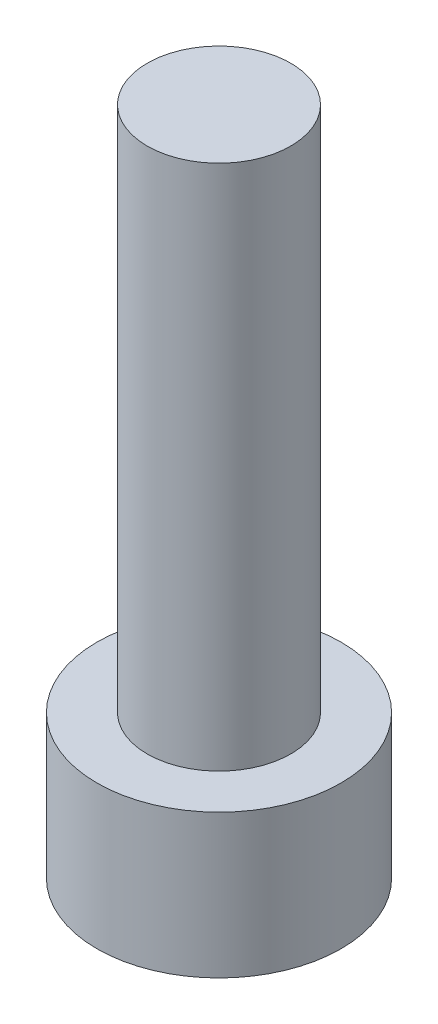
ISO-10303-21;
HEADER;
FILE_DESCRIPTION(('STEP AP214'),'2;1');
FILE_NAME('part.step','',(''),(''),'','','');
FILE_SCHEMA(('AUTOMOTIVE_DESIGN { 1 0 10303 214 1 1 1 1 }'));
ENDSEC;
DATA;
#1=APPLICATION_CONTEXT('core data for automotive mechanical design processes');
#2=APPLICATION_PROTOCOL_DEFINITION('international standard','automotive_design',2000,#1);
#3=PRODUCT_CONTEXT('',#1,'mechanical');
#4=PRODUCT('Part','Part','',(#3));
#5=PRODUCT_RELATED_PRODUCT_CATEGORY('part','',(#4));
#6=PRODUCT_DEFINITION_FORMATION('','',#4);
#7=PRODUCT_DEFINITION_CONTEXT('part definition',#1,'design');
#8=PRODUCT_DEFINITION('design','',#6,#7);
#9=PRODUCT_DEFINITION_SHAPE('','',#8);
#10=(LENGTH_UNIT() NAMED_UNIT(*) SI_UNIT(.MILLI.,.METRE.));
#11=(NAMED_UNIT(*) PLANE_ANGLE_UNIT() SI_UNIT($,.RADIAN.));
#12=(NAMED_UNIT(*) SI_UNIT($,.STERADIAN.) SOLID_ANGLE_UNIT());
#13=UNCERTAINTY_MEASURE_WITH_UNIT(LENGTH_MEASURE(1.E-05),#10,'distance_accuracy_value','');
#14=(GEOMETRIC_REPRESENTATION_CONTEXT(3) GLOBAL_UNCERTAINTY_ASSIGNED_CONTEXT((#13)) GLOBAL_UNIT_ASSIGNED_CONTEXT((#10,
#11,#12)) REPRESENTATION_CONTEXT('',''));
#15=CARTESIAN_POINT('',(0.,0.,0.));
#16=DIRECTION('',(0.,0.,1.));
#17=DIRECTION('',(1.,0.,0.));
#18=AXIS2_PLACEMENT_3D('',#15,#16,#17);
#19=CARTESIAN_POINT('',(0.,6.,0.));
#20=DIRECTION('',(0.,-1.,0.));
#21=DIRECTION('',(0.,0.,-1.));
#22=AXIS2_PLACEMENT_3D('',#19,#20,#21);
#23=CYLINDRICAL_SURFACE('',#22,5.1);
#24=CARTESIAN_POINT('',(0.,6.,0.));
#25=DIRECTION('',(0.,1.,0.));
#26=DIRECTION('',(0.,0.,1.));
#27=AXIS2_PLACEMENT_3D('',#24,#25,#26);
#28=CIRCLE('',#27,5.1);
#29=CARTESIAN_POINT('',(0.,6.,5.1));
#30=VERTEX_POINT('',#29);
#31=EDGE_CURVE('E51',#30,#30,#28,.T.);
#32=ORIENTED_EDGE('',*,*,#31,.F.);
#33=EDGE_LOOP('',(#32));
#34=FACE_BOUND('',#33,.T.);
#35=CARTESIAN_POINT('',(0.,0.,0.));
#36=DIRECTION('',(0.,1.,0.));
#37=DIRECTION('',(0.,0.,1.));
#38=AXIS2_PLACEMENT_3D('',#35,#36,#37);
#39=CIRCLE('',#38,5.1);
#40=CARTESIAN_POINT('',(0.,0.,5.1));
#41=VERTEX_POINT('',#40);
#42=EDGE_CURVE('E46',#41,#41,#39,.T.);
#43=ORIENTED_EDGE('',*,*,#42,.T.);
#44=EDGE_LOOP('',(#43));
#45=FACE_BOUND('',#44,.T.);
#46=ADVANCED_FACE('F43',(#34,#45),#23,.T.);
#47=CARTESIAN_POINT('',(0.,6.,0.));
#48=DIRECTION('',(0.,1.,0.));
#49=DIRECTION('',(0.,0.,1.));
#50=AXIS2_PLACEMENT_3D('',#47,#48,#49);
#51=PLANE('',#50);
#52=CARTESIAN_POINT('',(0.,6.,0.));
#53=DIRECTION('',(0.,1.,0.));
#54=DIRECTION('',(0.,0.,1.));
#55=AXIS2_PLACEMENT_3D('',#52,#53,#54);
#56=CIRCLE('',#55,3.);
#57=CARTESIAN_POINT('',(0.,6.,3.));
#58=VERTEX_POINT('',#57);
#59=EDGE_CURVE('E11',#58,#58,#56,.T.);
#60=ORIENTED_EDGE('',*,*,#59,.F.);
#61=EDGE_LOOP('',(#60));
#62=FACE_BOUND('',#61,.T.);
#63=ORIENTED_EDGE('',*,*,#31,.T.);
#64=EDGE_LOOP('',(#63));
#65=FACE_BOUND('',#64,.T.);
#66=ADVANCED_FACE('F161',(#62,#65),#51,.T.);
#67=CARTESIAN_POINT('',(0.,0.,0.));
#68=DIRECTION('',(0.,1.,0.));
#69=DIRECTION('',(0.,0.,1.));
#70=AXIS2_PLACEMENT_3D('',#67,#68,#69);
#71=PLANE('',#70);
#72=DIRECTION('',(0.091692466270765,0.,0.995787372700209));
#73=VECTOR('',#72,1.);
#74=CARTESIAN_POINT('',(2.3571217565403,0.,-1.66652643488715));
#75=LINE('',#74,#73);
#76=CARTESIAN_POINT('',(2.3571217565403,0.,-1.66652643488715));
#77=VERTEX_POINT('',#76);
#78=CARTESIAN_POINT('',(2.62181510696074,0.,1.20806410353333));
#79=VERTEX_POINT('',#78);
#80=EDGE_CURVE('E134',#77,#79,#75,.T.);
#81=ORIENTED_EDGE('',*,*,#80,.F.);
#82=DIRECTION('',(0.908223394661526,0.,0.418485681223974));
#83=VECTOR('',#82,1.);
#84=CARTESIAN_POINT('',(-0.264693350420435,0.,-2.87459053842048));
#85=LINE('',#84,#83);
#86=CARTESIAN_POINT('',(-0.264693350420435,0.,-2.87459053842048));
#87=VERTEX_POINT('',#86);
#88=EDGE_CURVE('E56',#87,#77,#85,.T.);
#89=ORIENTED_EDGE('',*,*,#88,.F.);
#90=DIRECTION('',(0.816530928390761,0.,-0.577301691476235));
#91=VECTOR('',#90,1.);
#92=CARTESIAN_POINT('',(-2.62181510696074,0.,-1.20806410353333));
#93=LINE('',#92,#91);
#94=CARTESIAN_POINT('',(-2.62181510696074,0.,-1.20806410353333));
#95=VERTEX_POINT('',#94);
#96=EDGE_CURVE('E145',#95,#87,#93,.T.);
#97=ORIENTED_EDGE('',*,*,#96,.F.);
#98=DIRECTION('',(-0.0916924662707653,0.,-0.995787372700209));
#99=VECTOR('',#98,1.);
#100=CARTESIAN_POINT('',(-2.3571217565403,0.,1.66652643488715));
#101=LINE('',#100,#99);
#102=CARTESIAN_POINT('',(-2.3571217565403,0.,1.66652643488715));
#103=VERTEX_POINT('',#102);
#104=EDGE_CURVE('E140',#103,#95,#101,.T.);
#105=ORIENTED_EDGE('',*,*,#104,.F.);
#106=DIRECTION('',(-0.908223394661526,0.,-0.418485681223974));
#107=VECTOR('',#106,1.);
#108=CARTESIAN_POINT('',(0.264693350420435,0.,2.87459053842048));
#109=LINE('',#108,#107);
#110=CARTESIAN_POINT('',(0.264693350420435,0.,2.87459053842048));
#111=VERTEX_POINT('',#110);
#112=EDGE_CURVE('E110',#111,#103,#109,.T.);
#113=ORIENTED_EDGE('',*,*,#112,.F.);
#114=DIRECTION('',(-0.816530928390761,0.,0.577301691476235));
#115=VECTOR('',#114,1.);
#116=CARTESIAN_POINT('',(2.62181510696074,0.,1.20806410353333));
#117=LINE('',#116,#115);
#118=EDGE_CURVE('E136',#79,#111,#117,.T.);
#119=ORIENTED_EDGE('',*,*,#118,.F.);
#120=EDGE_LOOP('',(#81,#89,#97,#105,#113,#119));
#121=FACE_BOUND('',#120,.T.);
#122=ORIENTED_EDGE('',*,*,#42,.F.);
#123=EDGE_LOOP('',(#122));
#124=FACE_BOUND('',#123,.T.);
#125=ADVANCED_FACE('F160',(#121,#124),#71,.F.);
#126=CARTESIAN_POINT('',(0.,28.,0.));
#127=DIRECTION('',(0.,-1.,0.));
#128=DIRECTION('',(0.,0.,-1.));
#129=AXIS2_PLACEMENT_3D('',#126,#127,#128);
#130=CYLINDRICAL_SURFACE('',#129,3.);
#131=CARTESIAN_POINT('',(0.,28.,0.));
#132=DIRECTION('',(0.,1.,0.));
#133=DIRECTION('',(0.,0.,1.));
#134=AXIS2_PLACEMENT_3D('',#131,#132,#133);
#135=CIRCLE('',#134,3.);
#136=CARTESIAN_POINT('',(0.,28.,3.));
#137=VERTEX_POINT('',#136);
#138=EDGE_CURVE('E147',#137,#137,#135,.T.);
#139=ORIENTED_EDGE('',*,*,#138,.F.);
#140=EDGE_LOOP('',(#139));
#141=FACE_BOUND('',#140,.T.);
#142=ORIENTED_EDGE('',*,*,#59,.T.);
#143=EDGE_LOOP('',(#142));
#144=FACE_BOUND('',#143,.T.);
#145=ADVANCED_FACE('F162',(#141,#144),#130,.T.);
#146=CARTESIAN_POINT('',(0.,28.,0.));
#147=DIRECTION('',(0.,1.,0.));
#148=DIRECTION('',(0.,0.,1.));
#149=AXIS2_PLACEMENT_3D('',#146,#147,#148);
#150=PLANE('',#149);
#151=ORIENTED_EDGE('',*,*,#138,.T.);
#152=EDGE_LOOP('',(#151));
#153=FACE_BOUND('',#152,.T.);
#154=ADVANCED_FACE('F167',(#153),#150,.T.);
#155=CARTESIAN_POINT('',(-0.264693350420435,3.,-2.87459053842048));
#156=DIRECTION('',(0.418485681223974,0.,-0.908223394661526));
#157=DIRECTION('',(-0.908223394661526,0.,-0.418485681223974));
#158=AXIS2_PLACEMENT_3D('',#155,#156,#157);
#159=PLANE('',#158);
#160=ORIENTED_EDGE('',*,*,#88,.T.);
#161=DIRECTION('',(0.,-1.,0.));
#162=VECTOR('',#161,1.);
#163=CARTESIAN_POINT('',(2.3571217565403,3.,-1.66652643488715));
#164=LINE('',#163,#162);
#165=CARTESIAN_POINT('',(2.3571217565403,3.,-1.66652643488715));
#166=VERTEX_POINT('',#165);
#167=EDGE_CURVE('E86',#166,#77,#164,.T.);
#168=ORIENTED_EDGE('',*,*,#167,.F.);
#169=DIRECTION('',(0.908223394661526,0.,0.418485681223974));
#170=VECTOR('',#169,1.);
#171=CARTESIAN_POINT('',(-0.264693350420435,3.,-2.87459053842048));
#172=LINE('',#171,#170);
#173=CARTESIAN_POINT('',(-0.264693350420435,3.,-2.87459053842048));
#174=VERTEX_POINT('',#173);
#175=EDGE_CURVE('E144',#174,#166,#172,.T.);
#176=ORIENTED_EDGE('',*,*,#175,.F.);
#177=DIRECTION('',(0.,-1.,0.));
#178=VECTOR('',#177,1.);
#179=CARTESIAN_POINT('',(-0.264693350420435,3.,-2.87459053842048));
#180=LINE('',#179,#178);
#181=EDGE_CURVE('E70',#174,#87,#180,.T.);
#182=ORIENTED_EDGE('',*,*,#181,.T.);
#183=EDGE_LOOP('',(#160,#168,#176,#182));
#184=FACE_BOUND('',#183,.T.);
#185=ADVANCED_FACE('F199',(#184),#159,.F.);
#186=CARTESIAN_POINT('',(-2.62181510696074,3.,-1.20806410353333));
#187=DIRECTION('',(-0.577301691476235,0.,-0.816530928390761));
#188=DIRECTION('',(-0.816530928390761,0.,0.577301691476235));
#189=AXIS2_PLACEMENT_3D('',#186,#187,#188);
#190=PLANE('',#189);
#191=ORIENTED_EDGE('',*,*,#96,.T.);
#192=ORIENTED_EDGE('',*,*,#181,.F.);
#193=DIRECTION('',(0.816530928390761,0.,-0.577301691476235));
#194=VECTOR('',#193,1.);
#195=CARTESIAN_POINT('',(-2.62181510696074,3.,-1.20806410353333));
#196=LINE('',#195,#194);
#197=CARTESIAN_POINT('',(-2.62181510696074,3.,-1.20806410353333));
#198=VERTEX_POINT('',#197);
#199=EDGE_CURVE('E118',#198,#174,#196,.T.);
#200=ORIENTED_EDGE('',*,*,#199,.F.);
#201=DIRECTION('',(0.,-1.,0.));
#202=VECTOR('',#201,1.);
#203=CARTESIAN_POINT('',(-2.62181510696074,3.,-1.20806410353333));
#204=LINE('',#203,#202);
#205=EDGE_CURVE('E111',#198,#95,#204,.T.);
#206=ORIENTED_EDGE('',*,*,#205,.T.);
#207=EDGE_LOOP('',(#191,#192,#200,#206));
#208=FACE_BOUND('',#207,.T.);
#209=ADVANCED_FACE('F208',(#208),#190,.F.);
#210=CARTESIAN_POINT('',(-2.3571217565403,3.,1.66652643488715));
#211=DIRECTION('',(-0.995787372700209,0.,0.0916924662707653));
#212=DIRECTION('',(0.0916924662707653,0.,0.995787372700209));
#213=AXIS2_PLACEMENT_3D('',#210,#211,#212);
#214=PLANE('',#213);
#215=ORIENTED_EDGE('',*,*,#104,.T.);
#216=ORIENTED_EDGE('',*,*,#205,.F.);
#217=DIRECTION('',(-0.0916924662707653,0.,-0.995787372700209));
#218=VECTOR('',#217,1.);
#219=CARTESIAN_POINT('',(-2.3571217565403,3.,1.66652643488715));
#220=LINE('',#219,#218);
#221=CARTESIAN_POINT('',(-2.3571217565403,3.,1.66652643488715));
#222=VERTEX_POINT('',#221);
#223=EDGE_CURVE('E114',#222,#198,#220,.T.);
#224=ORIENTED_EDGE('',*,*,#223,.F.);
#225=DIRECTION('',(0.,-1.,0.));
#226=VECTOR('',#225,1.);
#227=CARTESIAN_POINT('',(-2.3571217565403,3.,1.66652643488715));
#228=LINE('',#227,#226);
#229=EDGE_CURVE('E99',#222,#103,#228,.T.);
#230=ORIENTED_EDGE('',*,*,#229,.T.);
#231=EDGE_LOOP('',(#215,#216,#224,#230));
#232=FACE_BOUND('',#231,.T.);
#233=ADVANCED_FACE('F116',(#232),#214,.F.);
#234=CARTESIAN_POINT('',(0.264693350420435,3.,2.87459053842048));
#235=DIRECTION('',(-0.418485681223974,0.,0.908223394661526));
#236=DIRECTION('',(0.908223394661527,0.,0.418485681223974));
#237=AXIS2_PLACEMENT_3D('',#234,#235,#236);
#238=PLANE('',#237);
#239=ORIENTED_EDGE('',*,*,#112,.T.);
#240=ORIENTED_EDGE('',*,*,#229,.F.);
#241=DIRECTION('',(-0.908223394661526,0.,-0.418485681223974));
#242=VECTOR('',#241,1.);
#243=CARTESIAN_POINT('',(0.264693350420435,3.,2.87459053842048));
#244=LINE('',#243,#242);
#245=CARTESIAN_POINT('',(0.264693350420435,3.,2.87459053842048));
#246=VERTEX_POINT('',#245);
#247=EDGE_CURVE('E104',#246,#222,#244,.T.);
#248=ORIENTED_EDGE('',*,*,#247,.F.);
#249=DIRECTION('',(0.,-1.,0.));
#250=VECTOR('',#249,1.);
#251=CARTESIAN_POINT('',(0.264693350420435,3.,2.87459053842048));
#252=LINE('',#251,#250);
#253=EDGE_CURVE('E115',#246,#111,#252,.T.);
#254=ORIENTED_EDGE('',*,*,#253,.T.);
#255=EDGE_LOOP('',(#239,#240,#248,#254));
#256=FACE_BOUND('',#255,.T.);
#257=ADVANCED_FACE('F105',(#256),#238,.F.);
#258=CARTESIAN_POINT('',(2.62181510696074,3.,1.20806410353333));
#259=DIRECTION('',(0.577301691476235,0.,0.816530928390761));
#260=DIRECTION('',(0.816530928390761,0.,-0.577301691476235));
#261=AXIS2_PLACEMENT_3D('',#258,#259,#260);
#262=PLANE('',#261);
#263=ORIENTED_EDGE('',*,*,#118,.T.);
#264=ORIENTED_EDGE('',*,*,#253,.F.);
#265=DIRECTION('',(-0.816530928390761,0.,0.577301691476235));
#266=VECTOR('',#265,1.);
#267=CARTESIAN_POINT('',(2.62181510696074,3.,1.20806410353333));
#268=LINE('',#267,#266);
#269=CARTESIAN_POINT('',(2.62181510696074,3.,1.20806410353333));
#270=VERTEX_POINT('',#269);
#271=EDGE_CURVE('E123',#270,#246,#268,.T.);
#272=ORIENTED_EDGE('',*,*,#271,.F.);
#273=DIRECTION('',(0.,-1.,0.));
#274=VECTOR('',#273,1.);
#275=CARTESIAN_POINT('',(2.62181510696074,3.,1.20806410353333));
#276=LINE('',#275,#274);
#277=EDGE_CURVE('E146',#270,#79,#276,.T.);
#278=ORIENTED_EDGE('',*,*,#277,.T.);
#279=EDGE_LOOP('',(#263,#264,#272,#278));
#280=FACE_BOUND('',#279,.T.);
#281=ADVANCED_FACE('F232',(#280),#262,.F.);
#282=CARTESIAN_POINT('',(2.3571217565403,3.,-1.66652643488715));
#283=DIRECTION('',(0.995787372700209,0.,-0.091692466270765));
#284=DIRECTION('',(-0.091692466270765,0.,-0.995787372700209));
#285=AXIS2_PLACEMENT_3D('',#282,#283,#284);
#286=PLANE('',#285);
#287=ORIENTED_EDGE('',*,*,#80,.T.);
#288=ORIENTED_EDGE('',*,*,#277,.F.);
#289=DIRECTION('',(0.091692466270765,0.,0.995787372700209));
#290=VECTOR('',#289,1.);
#291=CARTESIAN_POINT('',(2.3571217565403,3.,-1.66652643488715));
#292=LINE('',#291,#290);
#293=EDGE_CURVE('E130',#166,#270,#292,.T.);
#294=ORIENTED_EDGE('',*,*,#293,.F.);
#295=ORIENTED_EDGE('',*,*,#167,.T.);
#296=EDGE_LOOP('',(#287,#288,#294,#295));
#297=FACE_BOUND('',#296,.T.);
#298=ADVANCED_FACE('F242',(#297),#286,.F.);
#299=CARTESIAN_POINT('',(0.,3.,0.));
#300=DIRECTION('',(0.,-1.,0.));
#301=DIRECTION('',(0.,0.,-1.));
#302=AXIS2_PLACEMENT_3D('',#299,#300,#301);
#303=PLANE('',#302);
#304=ORIENTED_EDGE('',*,*,#175,.T.);
#305=ORIENTED_EDGE('',*,*,#293,.T.);
#306=ORIENTED_EDGE('',*,*,#271,.T.);
#307=ORIENTED_EDGE('',*,*,#247,.T.);
#308=ORIENTED_EDGE('',*,*,#223,.T.);
#309=ORIENTED_EDGE('',*,*,#199,.T.);
#310=EDGE_LOOP('',(#304,#305,#306,#307,#308,#309));
#311=FACE_BOUND('',#310,.T.);
#312=ADVANCED_FACE('F125',(#311),#303,.T.);
#313=CLOSED_SHELL('',(#46,#66,#125,#145,#154,#185,#209,#233,#257,#281,#298,#312));
#314=MANIFOLD_SOLID_BREP('B2',#313);
#315=ADVANCED_BREP_SHAPE_REPRESENTATION('',(#18,#314),#14);
#316=SHAPE_DEFINITION_REPRESENTATION(#9,#315);
ENDSEC;
END-ISO-10303-21;
